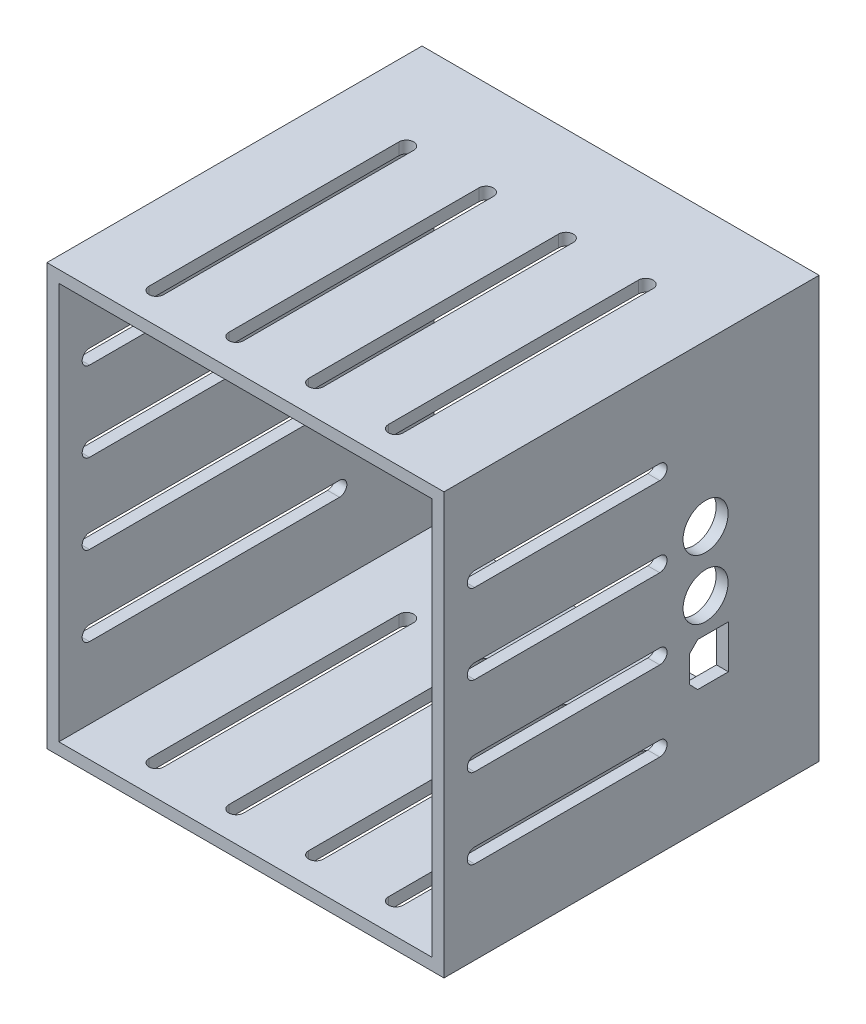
from build123d import *

# Parameters (mm, degrees)
SKETCH1_W         = 99.5
SKETCH1_H         = 105.5
SKETCH1_W_2       = 93.5
SKETCH1_H_2       = 99.5
WALLS_DEPTH       = 94
PORTS_REACH       = 9135.898
SKETCH2_R         = 5.6475
RAILS_CUT_1_DEPTH = 9134.769021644
RAILS_CUT_2_REACH = 9135.898
RAILS_CUT_3_REACH = 9135.898


with BuildPart() as part:
    # Sketch1 → Walls (new body)
    with BuildSketch(Plane.XY.offset(-9133.0073759)):
        with Locations((-3, 27)):
            Rectangle(SKETCH1_W, SKETCH1_H)
        with Locations((-3, 27)):
            Rectangle(SKETCH1_W_2, SKETCH1_H_2, mode=Mode.SUBTRACT)
    extrude(amount=WALLS_DEPTH)

    # Sketch2 → Ports (cut, up to next)
    with BuildSketch(Plane(origin=(46.75, 0, 0), x_dir=(0, 0, -1), z_dir=(1, 0, 0)), mode=Mode.PRIVATE) as ports_sk1:
        with Locations((9104.5603759, 24.4575)):
            Circle(SKETCH2_R)
    ports_tool1 = extrude(ports_sk1.sketch, amount=-PORTS_REACH, mode=Mode.PRIVATE) & part.part
    # Sketch2 → Ports (cut, up to next)
    with BuildSketch(Plane(origin=(46.75, 0, 0), x_dir=(0, 0, -1), z_dir=(1, 0, 0)), mode=Mode.PRIVATE) as ports_sk2:
        with Locations((9104.5603759, 39.4575)):
            Circle(SKETCH2_R)
    ports_tool2 = extrude(ports_sk2.sketch, amount=-PORTS_REACH, mode=Mode.PRIVATE) & part.part
    # Sketch2 → Ports (cut, up to next)
    with BuildSketch(Plane(origin=(46.75, 0, 0), x_dir=(0, 0, -1), z_dir=(1, 0, 0)), mode=Mode.PRIVATE) as ports_sk3:
        Polygon((9110.28056062, 5.0625), (9110.28056062, 15.9125), (9102.58056062, 15.9125), (9100.53056062, 13.8125), (9100.53056062, 7.1625), (9102.58056062, 5.0625), align=None)
    ports_tool3 = extrude(ports_sk3.sketch, amount=-PORTS_REACH, mode=Mode.PRIVATE) & part.part
    add(ports_tool1.solids().sort_by_distance((46.75, 24.4575, -9104.560376))[0], mode=Mode.SUBTRACT)
    add(ports_tool2.solids().sort_by_distance((46.75, 39.4575, -9104.560376))[0], mode=Mode.SUBTRACT)
    add(ports_tool3.solids().sort_by_distance((46.75, 10.4875, -9105.583376))[0], mode=Mode.SUBTRACT)

    # Sketch3 → Rails Cut 1 (cut, through all)
    with BuildSketch(Plane.XZ.offset(25.75)):
        with BuildLine():
            Line((-34.84, -9046.6873759), (-34.84, -9109.3273759))
            ThreePointArc((-34.84, -9109.3273759), (-33, -9111.1673759), (-31.16, -9109.3273759))
            Line((-31.16, -9109.3273759), (-31.16, -9046.6873759))
            ThreePointArc((-31.16, -9046.6873759), (-33, -9044.8473759), (-34.84, -9046.6873759))
        make_face()
        with BuildLine():
            Line((-14.84, -9046.6873759), (-14.84, -9109.3273759))
            ThreePointArc((-14.84, -9109.3273759), (-13, -9111.1673759), (-11.16, -9109.3273759))
            Line((-11.16, -9109.3273759), (-11.16, -9046.6873759))
            ThreePointArc((-11.16, -9046.6873759), (-13, -9044.8473759), (-14.84, -9046.6873759))
        make_face()
        with BuildLine():
            Line((5.16, -9046.6873759), (5.16, -9109.3273759))
            ThreePointArc((5.16, -9109.3273759), (7, -9111.1673759), (8.84, -9109.3273759))
            Line((8.84, -9109.3273759), (8.84, -9046.6873759))
            ThreePointArc((8.84, -9046.6873759), (7, -9044.8473759), (5.16, -9046.6873759))
        make_face()
        with BuildLine():
            Line((25.16, -9046.6873759), (25.16, -9109.3273759))
            ThreePointArc((25.16, -9109.3273759), (27, -9111.1673759), (28.84, -9109.3273759))
            Line((28.84, -9109.3273759), (28.84, -9046.6873759))
            ThreePointArc((28.84, -9046.6873759), (27, -9044.8473759), (25.16, -9046.6873759))
        make_face()
    extrude(amount=-RAILS_CUT_1_DEPTH, mode=Mode.SUBTRACT)

    # Sketch4 → Rails Cut 2 (cut, up to next)
    with BuildSketch(Plane.ZY.offset(52.75), mode=Mode.PRIVATE) as rails_cut_2_sk1:
        with BuildLine():
            Line((-9046.6873759, 58.84), (-9109.3273759, 58.84))
            ThreePointArc((-9109.3273759, 58.84), (-9111.1673759, 57), (-9109.3273759, 55.16))
            Line((-9109.3273759, 55.16), (-9046.6873759, 55.16))
            ThreePointArc((-9046.6873759, 55.16), (-9044.8473759, 57), (-9046.6873759, 58.84))
        make_face()
    rails_cut_2_tool1 = extrude(rails_cut_2_sk1.sketch, amount=-RAILS_CUT_2_REACH, mode=Mode.PRIVATE) & part.part
    # Sketch4 → Rails Cut 2 (cut, up to next)
    with BuildSketch(Plane.ZY.offset(52.75), mode=Mode.PRIVATE) as rails_cut_2_sk2:
        with BuildLine():
            Line((-9046.6873759, 38.84), (-9109.3273759, 38.84))
            ThreePointArc((-9109.3273759, 38.84), (-9111.1673759, 37), (-9109.3273759, 35.16))
            Line((-9109.3273759, 35.16), (-9046.6873759, 35.16))
            ThreePointArc((-9046.6873759, 35.16), (-9044.8473759, 37), (-9046.6873759, 38.84))
        make_face()
    rails_cut_2_tool2 = extrude(rails_cut_2_sk2.sketch, amount=-RAILS_CUT_2_REACH, mode=Mode.PRIVATE) & part.part
    # Sketch4 → Rails Cut 2 (cut, up to next)
    with BuildSketch(Plane.ZY.offset(52.75), mode=Mode.PRIVATE) as rails_cut_2_sk3:
        with BuildLine():
            Line((-9046.6873759, 18.84), (-9109.3273759, 18.84))
            ThreePointArc((-9109.3273759, 18.84), (-9111.1673759, 17), (-9109.3273759, 15.16))
            Line((-9109.3273759, 15.16), (-9046.6873759, 15.16))
            ThreePointArc((-9046.6873759, 15.16), (-9044.8473759, 17), (-9046.6873759, 18.84))
        make_face()
    rails_cut_2_tool3 = extrude(rails_cut_2_sk3.sketch, amount=-RAILS_CUT_2_REACH, mode=Mode.PRIVATE) & part.part
    # Sketch4 → Rails Cut 2 (cut, up to next)
    with BuildSketch(Plane.ZY.offset(52.75), mode=Mode.PRIVATE) as rails_cut_2_sk4:
        with BuildLine():
            Line((-9046.6873759, -1.16), (-9109.3273759, -1.16))
            ThreePointArc((-9109.3273759, -1.16), (-9111.1673759, -3), (-9109.3273759, -4.84))
            Line((-9109.3273759, -4.84), (-9046.6873759, -4.84))
            ThreePointArc((-9046.6873759, -4.84), (-9044.8473759, -3), (-9046.6873759, -1.16))
        make_face()
    rails_cut_2_tool4 = extrude(rails_cut_2_sk4.sketch, amount=-RAILS_CUT_2_REACH, mode=Mode.PRIVATE) & part.part
    add(rails_cut_2_tool1.solids().sort_by_distance((-52.75, 57, -9078.007376))[0], mode=Mode.SUBTRACT)
    add(rails_cut_2_tool2.solids().sort_by_distance((-52.75, 37, -9078.007376))[0], mode=Mode.SUBTRACT)
    add(rails_cut_2_tool3.solids().sort_by_distance((-52.75, 17, -9078.007376))[0], mode=Mode.SUBTRACT)
    add(rails_cut_2_tool4.solids().sort_by_distance((-52.75, -3, -9078.007376))[0], mode=Mode.SUBTRACT)

    # Sketch5 → Rails Cut 3 (cut, up to next)
    with BuildSketch(Plane(origin=(46.75, 0, 0), x_dir=(0, 0, -1), z_dir=(1, 0, 0)), mode=Mode.PRIVATE) as rails_cut_3_sk1:
        with BuildLine():
            Line((9046.6873759, -4.84), (9093.0728759, -4.84))
            ThreePointArc((9093.0728759, -4.84), (9094.9128759, -3), (9093.0728759, -1.16))
            Line((9093.0728759, -1.16), (9046.6873759, -1.16))
            ThreePointArc((9046.6873759, -1.16), (9044.8473759, -3), (9046.6873759, -4.84))
        make_face()
    rails_cut_3_tool1 = extrude(rails_cut_3_sk1.sketch, amount=-RAILS_CUT_3_REACH, mode=Mode.PRIVATE) & part.part
    # Sketch5 → Rails Cut 3 (cut, up to next)
    with BuildSketch(Plane(origin=(46.75, 0, 0), x_dir=(0, 0, -1), z_dir=(1, 0, 0)), mode=Mode.PRIVATE) as rails_cut_3_sk2:
        with BuildLine():
            Line((9046.6873759, 15.16), (9093.0728759, 15.16))
            ThreePointArc((9093.0728759, 15.16), (9094.9128759, 17), (9093.0728759, 18.84))
            Line((9093.0728759, 18.84), (9046.6873759, 18.84))
            ThreePointArc((9046.6873759, 18.84), (9044.8473759, 17), (9046.6873759, 15.16))
        make_face()
    rails_cut_3_tool2 = extrude(rails_cut_3_sk2.sketch, amount=-RAILS_CUT_3_REACH, mode=Mode.PRIVATE) & part.part
    # Sketch5 → Rails Cut 3 (cut, up to next)
    with BuildSketch(Plane(origin=(46.75, 0, 0), x_dir=(0, 0, -1), z_dir=(1, 0, 0)), mode=Mode.PRIVATE) as rails_cut_3_sk3:
        with BuildLine():
            Line((9046.6873759, 35.16), (9093.0728759, 35.16))
            ThreePointArc((9093.0728759, 35.16), (9094.9128759, 37), (9093.0728759, 38.84))
            Line((9093.0728759, 38.84), (9046.6873759, 38.84))
            ThreePointArc((9046.6873759, 38.84), (9044.8473759, 37), (9046.6873759, 35.16))
        make_face()
    rails_cut_3_tool3 = extrude(rails_cut_3_sk3.sketch, amount=-RAILS_CUT_3_REACH, mode=Mode.PRIVATE) & part.part
    # Sketch5 → Rails Cut 3 (cut, up to next)
    with BuildSketch(Plane(origin=(46.75, 0, 0), x_dir=(0, 0, -1), z_dir=(1, 0, 0)), mode=Mode.PRIVATE) as rails_cut_3_sk4:
        with BuildLine():
            Line((9046.6873759, 55.16), (9093.0728759, 55.16))
            ThreePointArc((9093.0728759, 55.16), (9094.9128759, 57), (9093.0728759, 58.84))
            Line((9093.0728759, 58.84), (9046.6873759, 58.84))
            ThreePointArc((9046.6873759, 58.84), (9044.8473759, 57), (9046.6873759, 55.16))
        make_face()
    rails_cut_3_tool4 = extrude(rails_cut_3_sk4.sketch, amount=-RAILS_CUT_3_REACH, mode=Mode.PRIVATE) & part.part
    add(rails_cut_3_tool1.solids().sort_by_distance((46.75, -3, -9069.880126))[0], mode=Mode.SUBTRACT)
    add(rails_cut_3_tool2.solids().sort_by_distance((46.75, 17, -9069.880126))[0], mode=Mode.SUBTRACT)
    add(rails_cut_3_tool3.solids().sort_by_distance((46.75, 37, -9069.880126))[0], mode=Mode.SUBTRACT)
    add(rails_cut_3_tool4.solids().sort_by_distance((46.75, 57, -9069.880126))[0], mode=Mode.SUBTRACT)


solid = part.part
